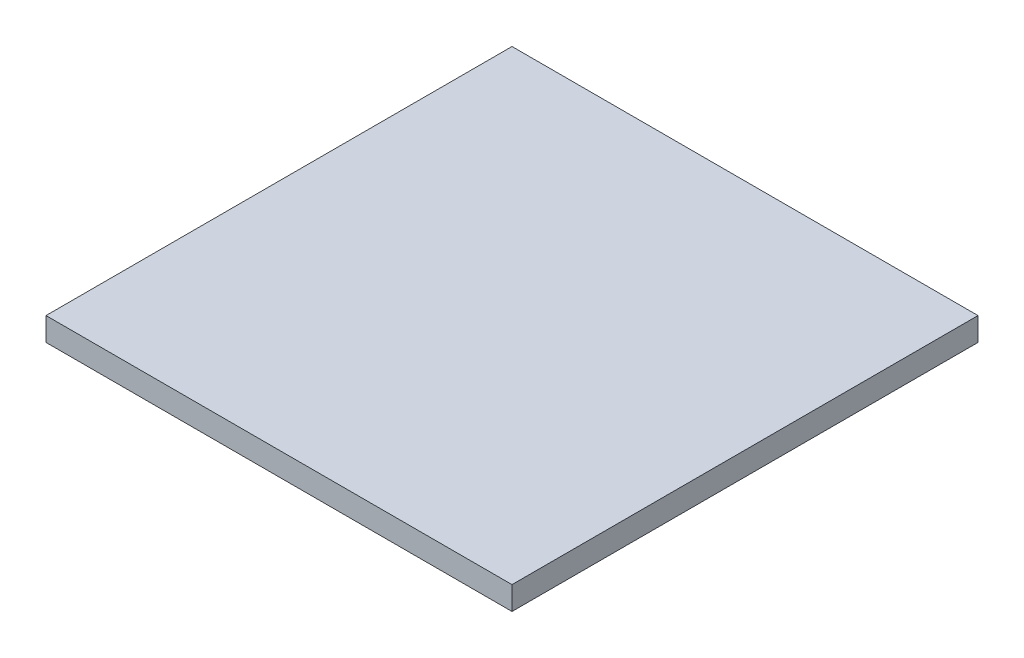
ISO-10303-21;
HEADER;
FILE_DESCRIPTION(('STEP AP214'),'2;1');
FILE_NAME('part.step','',(''),(''),'','','');
FILE_SCHEMA(('AUTOMOTIVE_DESIGN { 1 0 10303 214 1 1 1 1 }'));
ENDSEC;
DATA;
#1=APPLICATION_CONTEXT('core data for automotive mechanical design processes');
#2=APPLICATION_PROTOCOL_DEFINITION('international standard','automotive_design',2000,#1);
#3=PRODUCT_CONTEXT('',#1,'mechanical');
#4=PRODUCT('Part','Part','',(#3));
#5=PRODUCT_RELATED_PRODUCT_CATEGORY('part','',(#4));
#6=PRODUCT_DEFINITION_FORMATION('','',#4);
#7=PRODUCT_DEFINITION_CONTEXT('part definition',#1,'design');
#8=PRODUCT_DEFINITION('design','',#6,#7);
#9=PRODUCT_DEFINITION_SHAPE('','',#8);
#10=(LENGTH_UNIT() NAMED_UNIT(*) SI_UNIT(.MILLI.,.METRE.));
#11=(NAMED_UNIT(*) PLANE_ANGLE_UNIT() SI_UNIT($,.RADIAN.));
#12=(NAMED_UNIT(*) SI_UNIT($,.STERADIAN.) SOLID_ANGLE_UNIT());
#13=UNCERTAINTY_MEASURE_WITH_UNIT(LENGTH_MEASURE(1.E-05),#10,'distance_accuracy_value','');
#14=(GEOMETRIC_REPRESENTATION_CONTEXT(3) GLOBAL_UNCERTAINTY_ASSIGNED_CONTEXT((#13)) GLOBAL_UNIT_ASSIGNED_CONTEXT((#10,
#11,#12)) REPRESENTATION_CONTEXT('',''));
#15=CARTESIAN_POINT('',(0.,0.,0.));
#16=DIRECTION('',(0.,0.,1.));
#17=DIRECTION('',(1.,0.,0.));
#18=AXIS2_PLACEMENT_3D('',#15,#16,#17);
#19=CARTESIAN_POINT('',(0.,30.,0.));
#20=DIRECTION('',(1.,0.,0.));
#21=DIRECTION('',(0.,0.,-1.));
#22=AXIS2_PLACEMENT_3D('',#19,#20,#21);
#23=PLANE('',#22);
#24=DIRECTION('',(0.,0.,1.));
#25=VECTOR('',#24,1.);
#26=CARTESIAN_POINT('',(0.,0.,0.));
#27=LINE('',#26,#25);
#28=CARTESIAN_POINT('',(0.,0.,-600.));
#29=VERTEX_POINT('',#28);
#30=CARTESIAN_POINT('',(0.,0.,0.));
#31=VERTEX_POINT('',#30);
#32=EDGE_CURVE('E70',#29,#31,#27,.T.);
#33=ORIENTED_EDGE('',*,*,#32,.T.);
#34=DIRECTION('',(0.,-1.,0.));
#35=VECTOR('',#34,1.);
#36=CARTESIAN_POINT('',(0.,30.,0.));
#37=LINE('',#36,#35);
#38=CARTESIAN_POINT('',(0.,30.,0.));
#39=VERTEX_POINT('',#38);
#40=EDGE_CURVE('E11',#39,#31,#37,.T.);
#41=ORIENTED_EDGE('',*,*,#40,.F.);
#42=DIRECTION('',(0.,0.,1.));
#43=VECTOR('',#42,1.);
#44=CARTESIAN_POINT('',(0.,30.,0.));
#45=LINE('',#44,#43);
#46=CARTESIAN_POINT('',(0.,30.,-600.));
#47=VERTEX_POINT('',#46);
#48=EDGE_CURVE('E88',#47,#39,#45,.T.);
#49=ORIENTED_EDGE('',*,*,#48,.F.);
#50=DIRECTION('',(0.,-1.,0.));
#51=VECTOR('',#50,1.);
#52=CARTESIAN_POINT('',(0.,30.,-600.));
#53=LINE('',#52,#51);
#54=EDGE_CURVE('E82',#47,#29,#53,.T.);
#55=ORIENTED_EDGE('',*,*,#54,.T.);
#56=EDGE_LOOP('',(#33,#41,#49,#55));
#57=FACE_BOUND('',#56,.T.);
#58=ADVANCED_FACE('F26',(#57),#23,.F.);
#59=CARTESIAN_POINT('',(0.,30.,0.));
#60=DIRECTION('',(0.,0.,-1.));
#61=DIRECTION('',(-1.,0.,0.));
#62=AXIS2_PLACEMENT_3D('',#59,#60,#61);
#63=PLANE('',#62);
#64=DIRECTION('',(1.,0.,0.));
#65=VECTOR('',#64,1.);
#66=CARTESIAN_POINT('',(0.,0.,0.));
#67=LINE('',#66,#65);
#68=CARTESIAN_POINT('',(600.,0.,0.));
#69=VERTEX_POINT('',#68);
#70=EDGE_CURVE('E66',#31,#69,#67,.T.);
#71=ORIENTED_EDGE('',*,*,#70,.T.);
#72=DIRECTION('',(0.,-1.,0.));
#73=VECTOR('',#72,1.);
#74=CARTESIAN_POINT('',(600.,30.,0.));
#75=LINE('',#74,#73);
#76=CARTESIAN_POINT('',(600.,30.,0.));
#77=VERTEX_POINT('',#76);
#78=EDGE_CURVE('E33',#77,#69,#75,.T.);
#79=ORIENTED_EDGE('',*,*,#78,.F.);
#80=DIRECTION('',(1.,0.,0.));
#81=VECTOR('',#80,1.);
#82=CARTESIAN_POINT('',(0.,30.,0.));
#83=LINE('',#82,#81);
#84=EDGE_CURVE('E78',#39,#77,#83,.T.);
#85=ORIENTED_EDGE('',*,*,#84,.F.);
#86=ORIENTED_EDGE('',*,*,#40,.T.);
#87=EDGE_LOOP('',(#71,#79,#85,#86));
#88=FACE_BOUND('',#87,.T.);
#89=ADVANCED_FACE('F77',(#88),#63,.F.);
#90=CARTESIAN_POINT('',(600.,30.,0.));
#91=DIRECTION('',(-1.,0.,0.));
#92=DIRECTION('',(0.,0.,1.));
#93=AXIS2_PLACEMENT_3D('',#90,#91,#92);
#94=PLANE('',#93);
#95=DIRECTION('',(0.,0.,-1.));
#96=VECTOR('',#95,1.);
#97=CARTESIAN_POINT('',(600.,0.,0.));
#98=LINE('',#97,#96);
#99=CARTESIAN_POINT('',(600.,0.,-600.));
#100=VERTEX_POINT('',#99);
#101=EDGE_CURVE('E71',#69,#100,#98,.T.);
#102=ORIENTED_EDGE('',*,*,#101,.T.);
#103=DIRECTION('',(0.,-1.,0.));
#104=VECTOR('',#103,1.);
#105=CARTESIAN_POINT('',(600.,30.,-600.));
#106=LINE('',#105,#104);
#107=CARTESIAN_POINT('',(600.,30.,-600.));
#108=VERTEX_POINT('',#107);
#109=EDGE_CURVE('E94',#108,#100,#106,.T.);
#110=ORIENTED_EDGE('',*,*,#109,.F.);
#111=DIRECTION('',(0.,0.,-1.));
#112=VECTOR('',#111,1.);
#113=CARTESIAN_POINT('',(600.,30.,0.));
#114=LINE('',#113,#112);
#115=EDGE_CURVE('E45',#77,#108,#114,.T.);
#116=ORIENTED_EDGE('',*,*,#115,.F.);
#117=ORIENTED_EDGE('',*,*,#78,.T.);
#118=EDGE_LOOP('',(#102,#110,#116,#117));
#119=FACE_BOUND('',#118,.T.);
#120=ADVANCED_FACE('F97',(#119),#94,.F.);
#121=CARTESIAN_POINT('',(0.,30.,-600.));
#122=DIRECTION('',(0.,0.,1.));
#123=DIRECTION('',(1.,0.,0.));
#124=AXIS2_PLACEMENT_3D('',#121,#122,#123);
#125=PLANE('',#124);
#126=DIRECTION('',(-1.,0.,0.));
#127=VECTOR('',#126,1.);
#128=CARTESIAN_POINT('',(0.,0.,-600.));
#129=LINE('',#128,#127);
#130=EDGE_CURVE('E86',#100,#29,#129,.T.);
#131=ORIENTED_EDGE('',*,*,#130,.T.);
#132=ORIENTED_EDGE('',*,*,#54,.F.);
#133=DIRECTION('',(-1.,0.,0.));
#134=VECTOR('',#133,1.);
#135=CARTESIAN_POINT('',(0.,30.,-600.));
#136=LINE('',#135,#134);
#137=EDGE_CURVE('E40',#108,#47,#136,.T.);
#138=ORIENTED_EDGE('',*,*,#137,.F.);
#139=ORIENTED_EDGE('',*,*,#109,.T.);
#140=EDGE_LOOP('',(#131,#132,#138,#139));
#141=FACE_BOUND('',#140,.T.);
#142=ADVANCED_FACE('F99',(#141),#125,.F.);
#143=CARTESIAN_POINT('',(0.,30.,-600.));
#144=DIRECTION('',(0.,-1.,0.));
#145=DIRECTION('',(0.,0.,-1.));
#146=AXIS2_PLACEMENT_3D('',#143,#144,#145);
#147=PLANE('',#146);
#148=ORIENTED_EDGE('',*,*,#48,.T.);
#149=ORIENTED_EDGE('',*,*,#84,.T.);
#150=ORIENTED_EDGE('',*,*,#115,.T.);
#151=ORIENTED_EDGE('',*,*,#137,.T.);
#152=EDGE_LOOP('',(#148,#149,#150,#151));
#153=FACE_BOUND('',#152,.T.);
#154=ADVANCED_FACE('F100',(#153),#147,.F.);
#155=CARTESIAN_POINT('',(0.,0.,-600.));
#156=DIRECTION('',(0.,-1.,0.));
#157=DIRECTION('',(0.,0.,-1.));
#158=AXIS2_PLACEMENT_3D('',#155,#156,#157);
#159=PLANE('',#158);
#160=ORIENTED_EDGE('',*,*,#32,.F.);
#161=ORIENTED_EDGE('',*,*,#130,.F.);
#162=ORIENTED_EDGE('',*,*,#101,.F.);
#163=ORIENTED_EDGE('',*,*,#70,.F.);
#164=EDGE_LOOP('',(#160,#161,#162,#163));
#165=FACE_BOUND('',#164,.T.);
#166=ADVANCED_FACE('F67',(#165),#159,.T.);
#167=CLOSED_SHELL('',(#58,#89,#120,#142,#154,#166));
#168=MANIFOLD_SOLID_BREP('B2',#167);
#169=ADVANCED_BREP_SHAPE_REPRESENTATION('',(#18,#168),#14);
#170=SHAPE_DEFINITION_REPRESENTATION(#9,#169);
ENDSEC;
END-ISO-10303-21;
